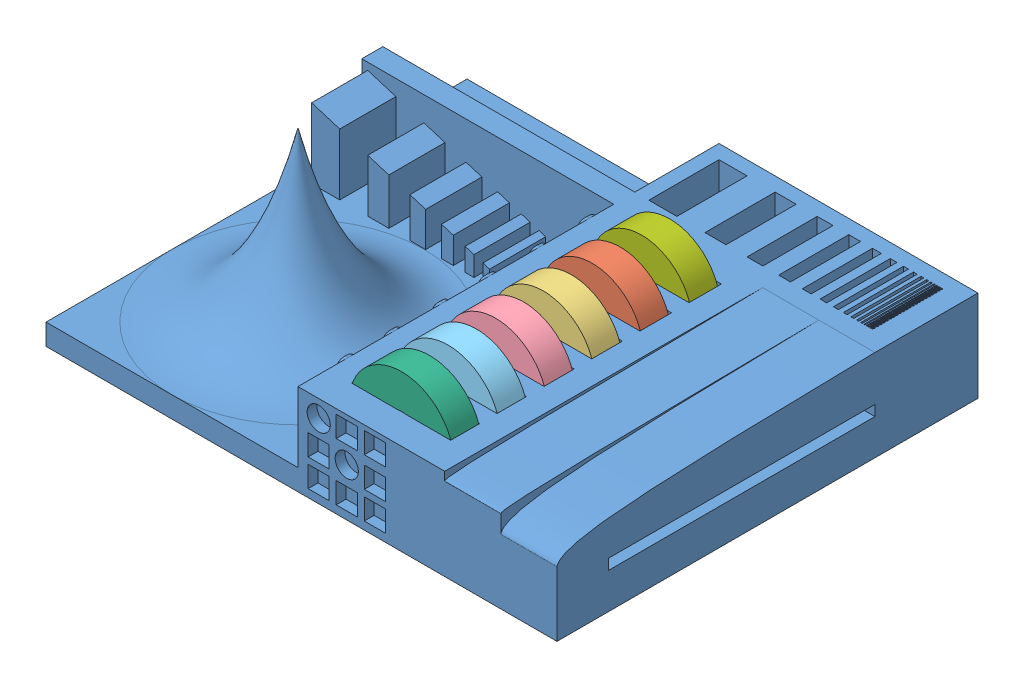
SolidWorks assembly testPrint.SLDASM, configuration Default (file format 7000). Lengths in mm.
Overall size (92.48 34.29 76.2).
7 component instances, 7 part files, 12 mates.
Components (placement in the parent):
- TestPart-1: TestPart.SLDPRT [Default] at origin size (92.48 34.29 76.2)
- moving0.0125-1: moving0.0125.SLDPRT [Default] at (58.8858 -3.2149 -39.9587) x (0.968012 -0.250903 0) z (0.250903 0.968012 0) size (18.41 5.08 18.41)
- moving0.01-1: moving0.01.SLDPRT [Default] at (58.8858 -3.2149 -31.1322) x (0.998547 -0.053879 0) z (0.053879 0.998547 0) size (18.54 5.08 18.54)
- moving0.0075-1: moving0.0075.SLDPRT [Default] at (58.8858 -3.2149 -22.4784) x (0.989118 -0.147127 0) z (0.147127 0.989118 0) size (18.67 5.08 18.67)
- moving0.005-1: moving0.005.SLDPRT [Default] at (58.8858 -3.2149 -13.9059) x (0.993869 -0.110568 0) z (0.110568 0.993869 0) size (18.8 5.08 18.8)
- moving0.0025-1: moving0.0025.SLDPRT [Default] at (58.8858 -3.2149 -5.4604) x (0.909279 -0.416187 0) z (0.416187 0.909279 0) size (18.92 5.08 18.92)
- moving0.015-1: moving0.015.SLDPRT [Default] at (58.8858 -3.2149 -48.9122) x (0.953176 -0.302416 0) z (0.302416 0.953176 0) size (18.29 5.08 18.29)
Mates (geometry in assembly coordinates):
- Concentric1: concentric anti-aligned: cylinder of TestPart-1 through (58.8858 -3.2149 -4.2082) axis (0 0 -1) radius 3.175; cylinder of moving0.0125-1 through (58.8858 -3.2149 -45.0387) axis (0 0 1) radius 3.4925
- Concentric2: concentric anti-aligned: cylinder of TestPart-1 through (58.8858 -3.2149 -4.2082) axis (0 0 -1) radius 3.175; cylinder of moving0.01-1 through (58.8858 -3.2149 -36.2122) axis (0 0 1) radius 3.429
- Concentric3: concentric anti-aligned: cylinder of TestPart-1 through (58.8858 -3.2149 -4.2082) axis (0 0 -1) radius 3.175; cylinder of moving0.0075-1 through (58.8858 -3.2149 -27.5584) axis (0 0 1) radius 3.3655
- Concentric4: concentric anti-aligned: cylinder of TestPart-1 through (58.8858 -3.2149 -4.2082) axis (0 0 -1) radius 3.175; cylinder of moving0.005-1 through (58.8858 -3.2149 -18.9859) axis (0 0 1) radius 3.302
- Concentric5: concentric anti-aligned: cylinder of TestPart-1 through (58.8858 -3.2149 -4.2082) axis (0 0 -1) radius 3.175; cylinder of moving0.0025-1 through (58.8858 -3.2149 -10.5404) axis (0 0 1) radius 3.2385
- Concentric6: concentric anti-aligned: cylinder of TestPart-1 through (58.8858 -3.2149 -4.2082) axis (0 0 -1) radius 3.175; cylinder of moving0.015-1 through (58.8858 -3.2149 -53.9922) axis (0 0 1) radius 3.2385
- Distance7: distance = 0.381 mm anti-aligned: plane of moving0.015-1 through (58.8858 -3.2149 -53.9922) normal (0 0 -1); plane of TestPart-1 through (45.6072 -16.51 -54.3732) normal (0 0 1)
- Distance8: distance = 0.3175 mm anti-aligned: plane of TestPart-1 through (0 -16.51 -45.3562) normal (0 0 1); plane of moving0.0125-1 through (58.8858 -3.2149 -45.0387) normal (0 0 -1)
- Distance9: distance = 0.254 mm anti-aligned: plane of moving0.01-1 through (58.8858 -3.2149 -36.2122) normal (0 0 -1); plane of TestPart-1 through (0 -16.51 -36.4662) normal (0 0 1)
- Distance10: distance = 0.1905 mm anti-aligned: plane of TestPart-1 through (0 -16.51 -27.7489) normal (0 0 1); plane of moving0.0075-1 through (58.8858 -3.2149 -27.5584) normal (0 0 -1)
- Distance11: distance = 0.127 mm anti-aligned: plane of moving0.005-1 through (58.8858 -3.2149 -18.9859) normal (0 0 -1); plane of TestPart-1 through (0 -16.51 -19.1129) normal (0 0 1)
- Distance12: distance = 0.0635 mm anti-aligned: plane of TestPart-1 through (0 -16.51 -10.6039) normal (0 0 1); plane of moving0.0025-1 through (58.8858 -3.2149 -10.5404) normal (0 0 -1)
